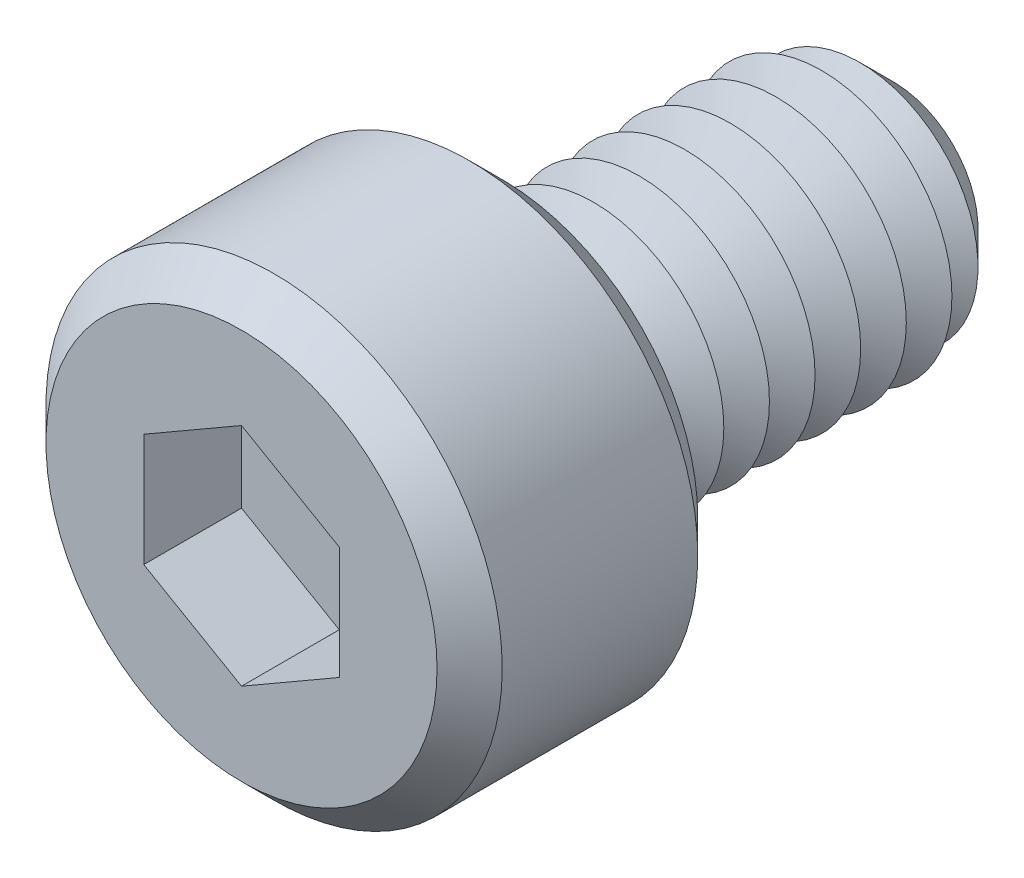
ISO-10303-21;
HEADER;
FILE_DESCRIPTION(('STEP AP214'),'2;1');
FILE_NAME('part.step','',(''),(''),'','','');
FILE_SCHEMA(('AUTOMOTIVE_DESIGN { 1 0 10303 214 1 1 1 1 }'));
ENDSEC;
DATA;
#1=APPLICATION_CONTEXT('core data for automotive mechanical design processes');
#2=APPLICATION_PROTOCOL_DEFINITION('international standard','automotive_design',2000,#1);
#3=PRODUCT_CONTEXT('',#1,'mechanical');
#4=PRODUCT('Part','Part','',(#3));
#5=PRODUCT_RELATED_PRODUCT_CATEGORY('part','',(#4));
#6=PRODUCT_DEFINITION_FORMATION('','',#4);
#7=PRODUCT_DEFINITION_CONTEXT('part definition',#1,'design');
#8=PRODUCT_DEFINITION('design','',#6,#7);
#9=PRODUCT_DEFINITION_SHAPE('','',#8);
#10=(LENGTH_UNIT() NAMED_UNIT(*) SI_UNIT(.MILLI.,.METRE.));
#11=(NAMED_UNIT(*) PLANE_ANGLE_UNIT() SI_UNIT($,.RADIAN.));
#12=(NAMED_UNIT(*) SI_UNIT($,.STERADIAN.) SOLID_ANGLE_UNIT());
#13=UNCERTAINTY_MEASURE_WITH_UNIT(LENGTH_MEASURE(1.E-05),#10,'distance_accuracy_value','');
#14=(GEOMETRIC_REPRESENTATION_CONTEXT(3) GLOBAL_UNCERTAINTY_ASSIGNED_CONTEXT((#13)) GLOBAL_UNIT_ASSIGNED_CONTEXT((#10,
#11,#12)) REPRESENTATION_CONTEXT('',''));
#15=CARTESIAN_POINT('',(0.,0.,0.));
#16=DIRECTION('',(0.,0.,1.));
#17=DIRECTION('',(1.,0.,0.));
#18=AXIS2_PLACEMENT_3D('',#15,#16,#17);
#19=CARTESIAN_POINT('',(0.,0.,4.));
#20=DIRECTION('',(0.,0.,-1.));
#21=DIRECTION('',(-1.,0.,0.));
#22=AXIS2_PLACEMENT_3D('',#19,#20,#21);
#23=CYLINDRICAL_SURFACE('',#22,3.5);
#24=CARTESIAN_POINT('',(0.,0.,0.500000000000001));
#25=DIRECTION('',(0.,0.,1.));
#26=DIRECTION('',(1.,0.,0.));
#27=AXIS2_PLACEMENT_3D('',#24,#25,#26);
#28=CIRCLE('',#27,3.5);
#29=CARTESIAN_POINT('',(3.5,0.,0.500000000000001));
#30=VERTEX_POINT('',#29);
#31=EDGE_CURVE('E241',#30,#30,#28,.T.);
#32=ORIENTED_EDGE('',*,*,#31,.T.);
#33=EDGE_LOOP('',(#32));
#34=FACE_BOUND('',#33,.T.);
#35=CARTESIAN_POINT('',(0.,0.,3.5));
#36=DIRECTION('',(0.,0.,1.));
#37=DIRECTION('',(1.,0.,0.));
#38=AXIS2_PLACEMENT_3D('',#35,#36,#37);
#39=CIRCLE('',#38,3.5);
#40=CARTESIAN_POINT('',(3.5,0.,3.5));
#41=VERTEX_POINT('',#40);
#42=EDGE_CURVE('E235',#41,#41,#39,.F.);
#43=ORIENTED_EDGE('',*,*,#42,.T.);
#44=EDGE_LOOP('',(#43));
#45=FACE_BOUND('',#44,.T.);
#46=ADVANCED_FACE('F39',(#34,#45),#23,.T.);
#47=CARTESIAN_POINT('',(0.,0.,4.));
#48=DIRECTION('',(0.,0.,1.));
#49=DIRECTION('',(1.,0.,0.));
#50=AXIS2_PLACEMENT_3D('',#47,#48,#49);
#51=PLANE('',#50);
#52=CARTESIAN_POINT('',(0.,0.,4.));
#53=DIRECTION('',(0.,0.,1.));
#54=DIRECTION('',(1.,0.,0.));
#55=AXIS2_PLACEMENT_3D('',#52,#53,#54);
#56=CIRCLE('',#55,3.);
#57=CARTESIAN_POINT('',(3.,0.,4.));
#58=VERTEX_POINT('',#57);
#59=EDGE_CURVE('E11',#58,#58,#56,.T.);
#60=ORIENTED_EDGE('',*,*,#59,.T.);
#61=EDGE_LOOP('',(#60));
#62=FACE_BOUND('',#61,.T.);
#63=DIRECTION('',(-0.866025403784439,0.5,0.));
#64=VECTOR('',#63,1.);
#65=CARTESIAN_POINT('',(1.5,0.866025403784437,4.));
#66=LINE('',#65,#64);
#67=CARTESIAN_POINT('',(1.5,0.866025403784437,4.));
#68=VERTEX_POINT('',#67);
#69=CARTESIAN_POINT('',(0.,1.73205080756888,4.));
#70=VERTEX_POINT('',#69);
#71=EDGE_CURVE('E55',#68,#70,#66,.T.);
#72=ORIENTED_EDGE('',*,*,#71,.F.);
#73=DIRECTION('',(0.,1.,0.));
#74=VECTOR('',#73,1.);
#75=CARTESIAN_POINT('',(1.5,-0.866025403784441,4.));
#76=LINE('',#75,#74);
#77=CARTESIAN_POINT('',(1.5,-0.866025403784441,4.));
#78=VERTEX_POINT('',#77);
#79=EDGE_CURVE('E151',#78,#68,#76,.T.);
#80=ORIENTED_EDGE('',*,*,#79,.F.);
#81=DIRECTION('',(0.866025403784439,0.5,0.));
#82=VECTOR('',#81,1.);
#83=CARTESIAN_POINT('',(0.,-1.73205080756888,4.));
#84=LINE('',#83,#82);
#85=CARTESIAN_POINT('',(0.,-1.73205080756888,4.));
#86=VERTEX_POINT('',#85);
#87=EDGE_CURVE('E148',#86,#78,#84,.T.);
#88=ORIENTED_EDGE('',*,*,#87,.F.);
#89=DIRECTION('',(0.866025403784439,-0.5,0.));
#90=VECTOR('',#89,1.);
#91=CARTESIAN_POINT('',(-1.5,-0.86602540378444,4.));
#92=LINE('',#91,#90);
#93=CARTESIAN_POINT('',(-1.5,-0.86602540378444,4.));
#94=VERTEX_POINT('',#93);
#95=EDGE_CURVE('E103',#94,#86,#92,.T.);
#96=ORIENTED_EDGE('',*,*,#95,.F.);
#97=DIRECTION('',(0.,-1.,0.));
#98=VECTOR('',#97,1.);
#99=CARTESIAN_POINT('',(-1.5,0.866025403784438,4.));
#100=LINE('',#99,#98);
#101=CARTESIAN_POINT('',(-1.5,0.866025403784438,4.));
#102=VERTEX_POINT('',#101);
#103=EDGE_CURVE('E142',#102,#94,#100,.T.);
#104=ORIENTED_EDGE('',*,*,#103,.F.);
#105=DIRECTION('',(-0.866025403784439,-0.5,0.));
#106=VECTOR('',#105,1.);
#107=CARTESIAN_POINT('',(0.,1.73205080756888,4.));
#108=LINE('',#107,#106);
#109=EDGE_CURVE('E137',#70,#102,#108,.T.);
#110=ORIENTED_EDGE('',*,*,#109,.F.);
#111=EDGE_LOOP('',(#72,#80,#88,#96,#104,#110));
#112=FACE_BOUND('',#111,.T.);
#113=ADVANCED_FACE('F259',(#62,#112),#51,.T.);
#114=CARTESIAN_POINT('',(0.,0.,0.));
#115=DIRECTION('',(0.,0.,1.));
#116=DIRECTION('',(1.,0.,0.));
#117=AXIS2_PLACEMENT_3D('',#114,#115,#116);
#118=PLANE('',#117);
#119=CARTESIAN_POINT('',(0.,0.,0.));
#120=DIRECTION('',(0.,0.,1.));
#121=DIRECTION('',(1.,0.,0.));
#122=AXIS2_PLACEMENT_3D('',#119,#120,#121);
#123=CIRCLE('',#122,3.);
#124=CARTESIAN_POINT('',(3.,0.,0.));
#125=VERTEX_POINT('',#124);
#126=EDGE_CURVE('E48',#125,#125,#123,.F.);
#127=ORIENTED_EDGE('',*,*,#126,.T.);
#128=EDGE_LOOP('',(#127));
#129=FACE_BOUND('',#128,.T.);
#130=CARTESIAN_POINT('',(0.,0.,0.));
#131=DIRECTION('',(0.,0.,1.));
#132=DIRECTION('',(1.,0.,0.));
#133=AXIS2_PLACEMENT_3D('',#130,#131,#132);
#134=CIRCLE('',#133,2.);
#135=CARTESIAN_POINT('',(2.,0.,0.));
#136=VERTEX_POINT('',#135);
#137=EDGE_CURVE('E227',#136,#136,#134,.T.);
#138=ORIENTED_EDGE('',*,*,#137,.T.);
#139=EDGE_LOOP('',(#138));
#140=FACE_BOUND('',#139,.T.);
#141=ADVANCED_FACE('F248',(#129,#140),#118,.F.);
#142=CARTESIAN_POINT('',(0.,0.,0.));
#143=DIRECTION('',(0.,0.,1.));
#144=DIRECTION('',(1.,0.,0.));
#145=AXIS2_PLACEMENT_3D('',#142,#143,#144);
#146=CONICAL_SURFACE('',#145,2.,1.0471975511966);
#147=CARTESIAN_POINT('',(0.,0.,-0.35));
#148=DIRECTION('',(0.,0.,1.));
#149=DIRECTION('',(1.,0.,0.));
#150=AXIS2_PLACEMENT_3D('',#147,#148,#149);
#151=CIRCLE('',#150,1.39378221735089);
#152=CARTESIAN_POINT('',(1.39378221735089,0.,-0.35));
#153=VERTEX_POINT('',#152);
#154=EDGE_CURVE('E223',#153,#153,#151,.T.);
#155=ORIENTED_EDGE('',*,*,#154,.T.);
#156=EDGE_LOOP('',(#155));
#157=FACE_BOUND('',#156,.T.);
#158=ORIENTED_EDGE('',*,*,#137,.F.);
#159=EDGE_LOOP('',(#158));
#160=FACE_BOUND('',#159,.T.);
#161=ADVANCED_FACE('F372',(#157,#160),#146,.T.);
#162=CARTESIAN_POINT('',(0.,0.,-0.35));
#163=DIRECTION('',(0.,0.,-1.));
#164=DIRECTION('',(-1.,0.,0.));
#165=AXIS2_PLACEMENT_3D('',#162,#163,#164);
#166=CONICAL_SURFACE('',#165,1.39378221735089,1.0471975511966);
#167=CARTESIAN_POINT('',(0.,0.,-0.7));
#168=DIRECTION('',(0.,0.,1.));
#169=DIRECTION('',(1.,0.,0.));
#170=AXIS2_PLACEMENT_3D('',#167,#168,#169);
#171=CIRCLE('',#170,2.);
#172=CARTESIAN_POINT('',(2.,0.,-0.7));
#173=VERTEX_POINT('',#172);
#174=EDGE_CURVE('E219',#173,#173,#171,.T.);
#175=ORIENTED_EDGE('',*,*,#174,.T.);
#176=EDGE_LOOP('',(#175));
#177=FACE_BOUND('',#176,.T.);
#178=ORIENTED_EDGE('',*,*,#154,.F.);
#179=EDGE_LOOP('',(#178));
#180=FACE_BOUND('',#179,.T.);
#181=ADVANCED_FACE('F368',(#177,#180),#166,.T.);
#182=CARTESIAN_POINT('',(0.,0.,-0.7));
#183=DIRECTION('',(0.,0.,1.));
#184=DIRECTION('',(1.,0.,0.));
#185=AXIS2_PLACEMENT_3D('',#182,#183,#184);
#186=CONICAL_SURFACE('',#185,2.,1.0471975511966);
#187=CARTESIAN_POINT('',(0.,0.,-1.05));
#188=DIRECTION('',(0.,0.,1.));
#189=DIRECTION('',(1.,0.,0.));
#190=AXIS2_PLACEMENT_3D('',#187,#188,#189);
#191=CIRCLE('',#190,1.39378221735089);
#192=CARTESIAN_POINT('',(1.39378221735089,0.,-1.05));
#193=VERTEX_POINT('',#192);
#194=EDGE_CURVE('E215',#193,#193,#191,.T.);
#195=ORIENTED_EDGE('',*,*,#194,.T.);
#196=EDGE_LOOP('',(#195));
#197=FACE_BOUND('',#196,.T.);
#198=ORIENTED_EDGE('',*,*,#174,.F.);
#199=EDGE_LOOP('',(#198));
#200=FACE_BOUND('',#199,.T.);
#201=ADVANCED_FACE('F364',(#197,#200),#186,.T.);
#202=CARTESIAN_POINT('',(0.,0.,-1.05));
#203=DIRECTION('',(0.,0.,-1.));
#204=DIRECTION('',(-1.,0.,0.));
#205=AXIS2_PLACEMENT_3D('',#202,#203,#204);
#206=CONICAL_SURFACE('',#205,1.39378221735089,1.0471975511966);
#207=CARTESIAN_POINT('',(0.,0.,-1.4));
#208=DIRECTION('',(0.,0.,1.));
#209=DIRECTION('',(1.,0.,0.));
#210=AXIS2_PLACEMENT_3D('',#207,#208,#209);
#211=CIRCLE('',#210,2.);
#212=CARTESIAN_POINT('',(2.,0.,-1.4));
#213=VERTEX_POINT('',#212);
#214=EDGE_CURVE('E211',#213,#213,#211,.T.);
#215=ORIENTED_EDGE('',*,*,#214,.T.);
#216=EDGE_LOOP('',(#215));
#217=FACE_BOUND('',#216,.T.);
#218=ORIENTED_EDGE('',*,*,#194,.F.);
#219=EDGE_LOOP('',(#218));
#220=FACE_BOUND('',#219,.T.);
#221=ADVANCED_FACE('F360',(#217,#220),#206,.T.);
#222=CARTESIAN_POINT('',(0.,0.,-1.4));
#223=DIRECTION('',(0.,0.,1.));
#224=DIRECTION('',(1.,0.,0.));
#225=AXIS2_PLACEMENT_3D('',#222,#223,#224);
#226=CONICAL_SURFACE('',#225,2.,1.0471975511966);
#227=CARTESIAN_POINT('',(0.,0.,-1.75));
#228=DIRECTION('',(0.,0.,1.));
#229=DIRECTION('',(1.,0.,0.));
#230=AXIS2_PLACEMENT_3D('',#227,#228,#229);
#231=CIRCLE('',#230,1.39378221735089);
#232=CARTESIAN_POINT('',(1.39378221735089,0.,-1.75));
#233=VERTEX_POINT('',#232);
#234=EDGE_CURVE('E207',#233,#233,#231,.T.);
#235=ORIENTED_EDGE('',*,*,#234,.T.);
#236=EDGE_LOOP('',(#235));
#237=FACE_BOUND('',#236,.T.);
#238=ORIENTED_EDGE('',*,*,#214,.F.);
#239=EDGE_LOOP('',(#238));
#240=FACE_BOUND('',#239,.T.);
#241=ADVANCED_FACE('F356',(#237,#240),#226,.T.);
#242=CARTESIAN_POINT('',(0.,0.,-1.75));
#243=DIRECTION('',(0.,0.,-1.));
#244=DIRECTION('',(-1.,0.,0.));
#245=AXIS2_PLACEMENT_3D('',#242,#243,#244);
#246=CONICAL_SURFACE('',#245,1.39378221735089,1.0471975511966);
#247=CARTESIAN_POINT('',(0.,0.,-2.1));
#248=DIRECTION('',(0.,0.,1.));
#249=DIRECTION('',(1.,0.,0.));
#250=AXIS2_PLACEMENT_3D('',#247,#248,#249);
#251=CIRCLE('',#250,2.);
#252=CARTESIAN_POINT('',(2.,0.,-2.1));
#253=VERTEX_POINT('',#252);
#254=EDGE_CURVE('E203',#253,#253,#251,.T.);
#255=ORIENTED_EDGE('',*,*,#254,.T.);
#256=EDGE_LOOP('',(#255));
#257=FACE_BOUND('',#256,.T.);
#258=ORIENTED_EDGE('',*,*,#234,.F.);
#259=EDGE_LOOP('',(#258));
#260=FACE_BOUND('',#259,.T.);
#261=ADVANCED_FACE('F352',(#257,#260),#246,.T.);
#262=CARTESIAN_POINT('',(0.,0.,-2.1));
#263=DIRECTION('',(0.,0.,1.));
#264=DIRECTION('',(1.,0.,0.));
#265=AXIS2_PLACEMENT_3D('',#262,#263,#264);
#266=CONICAL_SURFACE('',#265,2.,1.0471975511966);
#267=CARTESIAN_POINT('',(0.,0.,-2.45));
#268=DIRECTION('',(0.,0.,1.));
#269=DIRECTION('',(1.,0.,0.));
#270=AXIS2_PLACEMENT_3D('',#267,#268,#269);
#271=CIRCLE('',#270,1.39378221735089);
#272=CARTESIAN_POINT('',(1.39378221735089,0.,-2.45));
#273=VERTEX_POINT('',#272);
#274=EDGE_CURVE('E199',#273,#273,#271,.T.);
#275=ORIENTED_EDGE('',*,*,#274,.T.);
#276=EDGE_LOOP('',(#275));
#277=FACE_BOUND('',#276,.T.);
#278=ORIENTED_EDGE('',*,*,#254,.F.);
#279=EDGE_LOOP('',(#278));
#280=FACE_BOUND('',#279,.T.);
#281=ADVANCED_FACE('F348',(#277,#280),#266,.T.);
#282=CARTESIAN_POINT('',(0.,0.,-2.45));
#283=DIRECTION('',(0.,0.,-1.));
#284=DIRECTION('',(-1.,0.,0.));
#285=AXIS2_PLACEMENT_3D('',#282,#283,#284);
#286=CONICAL_SURFACE('',#285,1.39378221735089,1.0471975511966);
#287=CARTESIAN_POINT('',(0.,0.,-2.8));
#288=DIRECTION('',(0.,0.,1.));
#289=DIRECTION('',(1.,0.,0.));
#290=AXIS2_PLACEMENT_3D('',#287,#288,#289);
#291=CIRCLE('',#290,2.);
#292=CARTESIAN_POINT('',(2.,0.,-2.8));
#293=VERTEX_POINT('',#292);
#294=EDGE_CURVE('E195',#293,#293,#291,.T.);
#295=ORIENTED_EDGE('',*,*,#294,.T.);
#296=EDGE_LOOP('',(#295));
#297=FACE_BOUND('',#296,.T.);
#298=ORIENTED_EDGE('',*,*,#274,.F.);
#299=EDGE_LOOP('',(#298));
#300=FACE_BOUND('',#299,.T.);
#301=ADVANCED_FACE('F344',(#297,#300),#286,.T.);
#302=CARTESIAN_POINT('',(0.,0.,-2.8));
#303=DIRECTION('',(0.,0.,1.));
#304=DIRECTION('',(1.,0.,0.));
#305=AXIS2_PLACEMENT_3D('',#302,#303,#304);
#306=CONICAL_SURFACE('',#305,2.,1.0471975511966);
#307=CARTESIAN_POINT('',(0.,0.,-3.15));
#308=DIRECTION('',(0.,0.,1.));
#309=DIRECTION('',(1.,0.,0.));
#310=AXIS2_PLACEMENT_3D('',#307,#308,#309);
#311=CIRCLE('',#310,1.39378221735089);
#312=CARTESIAN_POINT('',(1.39378221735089,0.,-3.15));
#313=VERTEX_POINT('',#312);
#314=EDGE_CURVE('E191',#313,#313,#311,.T.);
#315=ORIENTED_EDGE('',*,*,#314,.T.);
#316=EDGE_LOOP('',(#315));
#317=FACE_BOUND('',#316,.T.);
#318=ORIENTED_EDGE('',*,*,#294,.F.);
#319=EDGE_LOOP('',(#318));
#320=FACE_BOUND('',#319,.T.);
#321=ADVANCED_FACE('F340',(#317,#320),#306,.T.);
#322=CARTESIAN_POINT('',(0.,0.,-3.15));
#323=DIRECTION('',(0.,0.,-1.));
#324=DIRECTION('',(-1.,0.,0.));
#325=AXIS2_PLACEMENT_3D('',#322,#323,#324);
#326=CONICAL_SURFACE('',#325,1.39378221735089,1.0471975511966);
#327=CARTESIAN_POINT('',(0.,0.,-3.5));
#328=DIRECTION('',(0.,0.,1.));
#329=DIRECTION('',(1.,0.,0.));
#330=AXIS2_PLACEMENT_3D('',#327,#328,#329);
#331=CIRCLE('',#330,2.);
#332=CARTESIAN_POINT('',(2.,0.,-3.5));
#333=VERTEX_POINT('',#332);
#334=EDGE_CURVE('E187',#333,#333,#331,.T.);
#335=ORIENTED_EDGE('',*,*,#334,.T.);
#336=EDGE_LOOP('',(#335));
#337=FACE_BOUND('',#336,.T.);
#338=ORIENTED_EDGE('',*,*,#314,.F.);
#339=EDGE_LOOP('',(#338));
#340=FACE_BOUND('',#339,.T.);
#341=ADVANCED_FACE('F336',(#337,#340),#326,.T.);
#342=CARTESIAN_POINT('',(0.,0.,-3.5));
#343=DIRECTION('',(0.,0.,1.));
#344=DIRECTION('',(1.,0.,0.));
#345=AXIS2_PLACEMENT_3D('',#342,#343,#344);
#346=CONICAL_SURFACE('',#345,2.,1.0471975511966);
#347=CARTESIAN_POINT('',(0.,0.,-3.85));
#348=DIRECTION('',(0.,0.,1.));
#349=DIRECTION('',(1.,0.,0.));
#350=AXIS2_PLACEMENT_3D('',#347,#348,#349);
#351=CIRCLE('',#350,1.39378221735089);
#352=CARTESIAN_POINT('',(1.39378221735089,0.,-3.85));
#353=VERTEX_POINT('',#352);
#354=EDGE_CURVE('E183',#353,#353,#351,.T.);
#355=ORIENTED_EDGE('',*,*,#354,.T.);
#356=EDGE_LOOP('',(#355));
#357=FACE_BOUND('',#356,.T.);
#358=ORIENTED_EDGE('',*,*,#334,.F.);
#359=EDGE_LOOP('',(#358));
#360=FACE_BOUND('',#359,.T.);
#361=ADVANCED_FACE('F332',(#357,#360),#346,.T.);
#362=CARTESIAN_POINT('',(0.,0.,-3.85));
#363=DIRECTION('',(0.,0.,-1.));
#364=DIRECTION('',(-1.,0.,0.));
#365=AXIS2_PLACEMENT_3D('',#362,#363,#364);
#366=CONICAL_SURFACE('',#365,1.39378221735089,1.0471975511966);
#367=CARTESIAN_POINT('',(0.,0.,-4.2));
#368=DIRECTION('',(0.,0.,1.));
#369=DIRECTION('',(1.,0.,0.));
#370=AXIS2_PLACEMENT_3D('',#367,#368,#369);
#371=CIRCLE('',#370,2.);
#372=CARTESIAN_POINT('',(2.,0.,-4.2));
#373=VERTEX_POINT('',#372);
#374=EDGE_CURVE('E179',#373,#373,#371,.T.);
#375=ORIENTED_EDGE('',*,*,#374,.T.);
#376=EDGE_LOOP('',(#375));
#377=FACE_BOUND('',#376,.T.);
#378=ORIENTED_EDGE('',*,*,#354,.F.);
#379=EDGE_LOOP('',(#378));
#380=FACE_BOUND('',#379,.T.);
#381=ADVANCED_FACE('F328',(#377,#380),#366,.T.);
#382=CARTESIAN_POINT('',(0.,0.,-4.2));
#383=DIRECTION('',(0.,0.,1.));
#384=DIRECTION('',(1.,0.,0.));
#385=AXIS2_PLACEMENT_3D('',#382,#383,#384);
#386=CONICAL_SURFACE('',#385,2.,1.0471975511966);
#387=CARTESIAN_POINT('',(0.,0.,-4.55));
#388=DIRECTION('',(0.,0.,1.));
#389=DIRECTION('',(1.,0.,0.));
#390=AXIS2_PLACEMENT_3D('',#387,#388,#389);
#391=CIRCLE('',#390,1.39378221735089);
#392=CARTESIAN_POINT('',(1.39378221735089,0.,-4.55));
#393=VERTEX_POINT('',#392);
#394=EDGE_CURVE('E175',#393,#393,#391,.T.);
#395=ORIENTED_EDGE('',*,*,#394,.T.);
#396=EDGE_LOOP('',(#395));
#397=FACE_BOUND('',#396,.T.);
#398=ORIENTED_EDGE('',*,*,#374,.F.);
#399=EDGE_LOOP('',(#398));
#400=FACE_BOUND('',#399,.T.);
#401=ADVANCED_FACE('F324',(#397,#400),#386,.T.);
#402=CARTESIAN_POINT('',(0.,0.,-4.55));
#403=DIRECTION('',(0.,0.,-1.));
#404=DIRECTION('',(-1.,0.,0.));
#405=AXIS2_PLACEMENT_3D('',#402,#403,#404);
#406=CONICAL_SURFACE('',#405,1.39378221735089,1.0471975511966);
#407=CARTESIAN_POINT('',(0.,0.,-4.9));
#408=DIRECTION('',(0.,0.,1.));
#409=DIRECTION('',(1.,0.,0.));
#410=AXIS2_PLACEMENT_3D('',#407,#408,#409);
#411=CIRCLE('',#410,2.);
#412=CARTESIAN_POINT('',(2.,0.,-4.9));
#413=VERTEX_POINT('',#412);
#414=EDGE_CURVE('E170',#413,#413,#411,.T.);
#415=ORIENTED_EDGE('',*,*,#414,.T.);
#416=EDGE_LOOP('',(#415));
#417=FACE_BOUND('',#416,.T.);
#418=ORIENTED_EDGE('',*,*,#394,.F.);
#419=EDGE_LOOP('',(#418));
#420=FACE_BOUND('',#419,.T.);
#421=ADVANCED_FACE('F320',(#417,#420),#406,.T.);
#422=CARTESIAN_POINT('',(0.,0.,-4.9));
#423=DIRECTION('',(0.,0.,1.));
#424=DIRECTION('',(1.,0.,0.));
#425=AXIS2_PLACEMENT_3D('',#422,#423,#424);
#426=CONICAL_SURFACE('',#425,2.,1.0471975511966);
#427=CARTESIAN_POINT('',(0.,0.,-5.25));
#428=DIRECTION('',(0.,0.,1.));
#429=DIRECTION('',(1.,0.,0.));
#430=AXIS2_PLACEMENT_3D('',#427,#428,#429);
#431=CIRCLE('',#430,1.39378221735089);
#432=CARTESIAN_POINT('',(1.39378221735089,0.,-5.25));
#433=VERTEX_POINT('',#432);
#434=EDGE_CURVE('E157',#433,#433,#431,.T.);
#435=ORIENTED_EDGE('',*,*,#434,.T.);
#436=EDGE_LOOP('',(#435));
#437=FACE_BOUND('',#436,.T.);
#438=ORIENTED_EDGE('',*,*,#414,.F.);
#439=EDGE_LOOP('',(#438));
#440=FACE_BOUND('',#439,.T.);
#441=ADVANCED_FACE('F316',(#437,#440),#426,.T.);
#442=CARTESIAN_POINT('',(0.,0.,-5.25));
#443=DIRECTION('',(0.,0.,-1.));
#444=DIRECTION('',(-1.,0.,0.));
#445=AXIS2_PLACEMENT_3D('',#442,#443,#444);
#446=CONICAL_SURFACE('',#445,1.39378221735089,1.0471975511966);
#447=CARTESIAN_POINT('',(0.,0.,-5.49019237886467));
#448=DIRECTION('',(0.,0.,-1.));
#449=DIRECTION('',(-1.,0.,0.));
#450=AXIS2_PLACEMENT_3D('',#447,#448,#449);
#451=CIRCLE('',#450,1.80980762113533);
#452=CARTESIAN_POINT('',(-1.80980762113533,0.,-5.49019237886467));
#453=VERTEX_POINT('',#452);
#454=EDGE_CURVE('E174',#453,#453,#451,.T.);
#455=ORIENTED_EDGE('',*,*,#454,.F.);
#456=EDGE_LOOP('',(#455));
#457=FACE_BOUND('',#456,.T.);
#458=ORIENTED_EDGE('',*,*,#434,.F.);
#459=EDGE_LOOP('',(#458));
#460=FACE_BOUND('',#459,.T.);
#461=ADVANCED_FACE('F312',(#457,#460),#446,.T.);
#462=CARTESIAN_POINT('',(0.,0.,-6.));
#463=DIRECTION('',(0.,0.,-1.));
#464=DIRECTION('',(-1.,0.,0.));
#465=AXIS2_PLACEMENT_3D('',#462,#463,#464);
#466=PLANE('',#465);
#467=CARTESIAN_POINT('',(0.,0.,-6.));
#468=DIRECTION('',(0.,0.,-1.));
#469=DIRECTION('',(-1.,0.,0.));
#470=AXIS2_PLACEMENT_3D('',#467,#468,#469);
#471=CIRCLE('',#470,0.5);
#472=CARTESIAN_POINT('',(-0.5,0.,-6.));
#473=VERTEX_POINT('',#472);
#474=EDGE_CURVE('E138',#473,#473,#471,.F.);
#475=ORIENTED_EDGE('',*,*,#474,.T.);
#476=EDGE_LOOP('',(#475));
#477=FACE_BOUND('',#476,.T.);
#478=CARTESIAN_POINT('',(0.,0.,-6.));
#479=DIRECTION('',(0.,0.,-1.));
#480=DIRECTION('',(-1.,0.,0.));
#481=AXIS2_PLACEMENT_3D('',#478,#479,#480);
#482=CIRCLE('',#481,1.3);
#483=CARTESIAN_POINT('',(-1.3,0.,-6.));
#484=VERTEX_POINT('',#483);
#485=EDGE_CURVE('E231',#484,#484,#482,.T.);
#486=ORIENTED_EDGE('',*,*,#485,.T.);
#487=EDGE_LOOP('',(#486));
#488=FACE_BOUND('',#487,.T.);
#489=ADVANCED_FACE('F315',(#477,#488),#466,.T.);
#490=CARTESIAN_POINT('',(0.,0.,-6.));
#491=DIRECTION('',(0.,0.,1.));
#492=DIRECTION('',(1.,0.,0.));
#493=AXIS2_PLACEMENT_3D('',#490,#491,#492);
#494=CONICAL_SURFACE('',#493,1.3,0.785398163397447);
#495=ORIENTED_EDGE('',*,*,#485,.F.);
#496=EDGE_LOOP('',(#495));
#497=FACE_BOUND('',#496,.T.);
#498=ORIENTED_EDGE('',*,*,#454,.T.);
#499=EDGE_LOOP('',(#498));
#500=FACE_BOUND('',#499,.T.);
#501=ADVANCED_FACE('F311',(#497,#500),#494,.T.);
#502=CARTESIAN_POINT('',(1.5,0.866025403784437,2.5));
#503=DIRECTION('',(0.5,0.866025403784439,0.));
#504=DIRECTION('',(-0.866025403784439,0.5,0.));
#505=AXIS2_PLACEMENT_3D('',#502,#503,#504);
#506=PLANE('',#505);
#507=ORIENTED_EDGE('',*,*,#71,.T.);
#508=DIRECTION('',(0.,0.,1.));
#509=VECTOR('',#508,1.);
#510=CARTESIAN_POINT('',(0.,1.73205080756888,2.5));
#511=LINE('',#510,#509);
#512=CARTESIAN_POINT('',(0.,1.73205080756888,2.5));
#513=VERTEX_POINT('',#512);
#514=EDGE_CURVE('E85',#513,#70,#511,.T.);
#515=ORIENTED_EDGE('',*,*,#514,.F.);
#516=DIRECTION('',(-0.866025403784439,0.5,0.));
#517=VECTOR('',#516,1.);
#518=CARTESIAN_POINT('',(1.5,0.866025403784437,2.5));
#519=LINE('',#518,#517);
#520=CARTESIAN_POINT('',(1.5,0.866025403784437,2.5));
#521=VERTEX_POINT('',#520);
#522=EDGE_CURVE('E154',#521,#513,#519,.T.);
#523=ORIENTED_EDGE('',*,*,#522,.F.);
#524=DIRECTION('',(0.,0.,1.));
#525=VECTOR('',#524,1.);
#526=CARTESIAN_POINT('',(1.5,0.866025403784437,2.5));
#527=LINE('',#526,#525);
#528=EDGE_CURVE('E63',#521,#68,#527,.T.);
#529=ORIENTED_EDGE('',*,*,#528,.T.);
#530=EDGE_LOOP('',(#507,#515,#523,#529));
#531=FACE_BOUND('',#530,.T.);
#532=ADVANCED_FACE('F301',(#531),#506,.F.);
#533=CARTESIAN_POINT('',(1.5,-0.866025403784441,2.5));
#534=DIRECTION('',(1.,0.,0.));
#535=DIRECTION('',(0.,1.,0.));
#536=AXIS2_PLACEMENT_3D('',#533,#534,#535);
#537=PLANE('',#536);
#538=ORIENTED_EDGE('',*,*,#79,.T.);
#539=ORIENTED_EDGE('',*,*,#528,.F.);
#540=DIRECTION('',(0.,1.,0.));
#541=VECTOR('',#540,1.);
#542=CARTESIAN_POINT('',(1.5,-0.866025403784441,2.5));
#543=LINE('',#542,#541);
#544=CARTESIAN_POINT('',(1.5,-0.866025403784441,2.5));
#545=VERTEX_POINT('',#544);
#546=EDGE_CURVE('E117',#545,#521,#543,.T.);
#547=ORIENTED_EDGE('',*,*,#546,.F.);
#548=DIRECTION('',(0.,0.,1.));
#549=VECTOR('',#548,1.);
#550=CARTESIAN_POINT('',(1.5,-0.866025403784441,2.5));
#551=LINE('',#550,#549);
#552=EDGE_CURVE('E108',#545,#78,#551,.T.);
#553=ORIENTED_EDGE('',*,*,#552,.T.);
#554=EDGE_LOOP('',(#538,#539,#547,#553));
#555=FACE_BOUND('',#554,.T.);
#556=ADVANCED_FACE('F298',(#555),#537,.F.);
#557=CARTESIAN_POINT('',(0.,-1.73205080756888,2.5));
#558=DIRECTION('',(0.5,-0.866025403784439,0.));
#559=DIRECTION('',(0.866025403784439,0.5,0.));
#560=AXIS2_PLACEMENT_3D('',#557,#558,#559);
#561=PLANE('',#560);
#562=ORIENTED_EDGE('',*,*,#87,.T.);
#563=ORIENTED_EDGE('',*,*,#552,.F.);
#564=DIRECTION('',(0.866025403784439,0.5,0.));
#565=VECTOR('',#564,1.);
#566=CARTESIAN_POINT('',(0.,-1.73205080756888,2.5));
#567=LINE('',#566,#565);
#568=CARTESIAN_POINT('',(0.,-1.73205080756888,2.5));
#569=VERTEX_POINT('',#568);
#570=EDGE_CURVE('E112',#569,#545,#567,.T.);
#571=ORIENTED_EDGE('',*,*,#570,.F.);
#572=DIRECTION('',(0.,0.,1.));
#573=VECTOR('',#572,1.);
#574=CARTESIAN_POINT('',(0.,-1.73205080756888,2.5));
#575=LINE('',#574,#573);
#576=EDGE_CURVE('E96',#569,#86,#575,.T.);
#577=ORIENTED_EDGE('',*,*,#576,.T.);
#578=EDGE_LOOP('',(#562,#563,#571,#577));
#579=FACE_BOUND('',#578,.T.);
#580=ADVANCED_FACE('F113',(#579),#561,.F.);
#581=CARTESIAN_POINT('',(-1.5,-0.86602540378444,2.5));
#582=DIRECTION('',(-0.5,-0.866025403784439,0.));
#583=DIRECTION('',(0.866025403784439,-0.5,0.));
#584=AXIS2_PLACEMENT_3D('',#581,#582,#583);
#585=PLANE('',#584);
#586=ORIENTED_EDGE('',*,*,#95,.T.);
#587=ORIENTED_EDGE('',*,*,#576,.F.);
#588=DIRECTION('',(0.866025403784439,-0.5,0.));
#589=VECTOR('',#588,1.);
#590=CARTESIAN_POINT('',(-1.5,-0.86602540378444,2.5));
#591=LINE('',#590,#589);
#592=CARTESIAN_POINT('',(-1.5,-0.86602540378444,2.5));
#593=VERTEX_POINT('',#592);
#594=EDGE_CURVE('E100',#593,#569,#591,.T.);
#595=ORIENTED_EDGE('',*,*,#594,.F.);
#596=DIRECTION('',(0.,0.,1.));
#597=VECTOR('',#596,1.);
#598=CARTESIAN_POINT('',(-1.5,-0.86602540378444,2.5));
#599=LINE('',#598,#597);
#600=EDGE_CURVE('E109',#593,#94,#599,.T.);
#601=ORIENTED_EDGE('',*,*,#600,.T.);
#602=EDGE_LOOP('',(#586,#587,#595,#601));
#603=FACE_BOUND('',#602,.T.);
#604=ADVANCED_FACE('F98',(#603),#585,.F.);
#605=CARTESIAN_POINT('',(-1.5,0.866025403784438,2.5));
#606=DIRECTION('',(-1.,0.,0.));
#607=DIRECTION('',(0.,0.,1.));
#608=AXIS2_PLACEMENT_3D('',#605,#606,#607);
#609=PLANE('',#608);
#610=ORIENTED_EDGE('',*,*,#103,.T.);
#611=ORIENTED_EDGE('',*,*,#600,.F.);
#612=DIRECTION('',(0.,-1.,0.));
#613=VECTOR('',#612,1.);
#614=CARTESIAN_POINT('',(-1.5,0.866025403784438,2.5));
#615=LINE('',#614,#613);
#616=CARTESIAN_POINT('',(-1.5,0.866025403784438,2.5));
#617=VERTEX_POINT('',#616);
#618=EDGE_CURVE('E123',#617,#593,#615,.T.);
#619=ORIENTED_EDGE('',*,*,#618,.F.);
#620=DIRECTION('',(0.,0.,1.));
#621=VECTOR('',#620,1.);
#622=CARTESIAN_POINT('',(-1.5,0.866025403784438,2.5));
#623=LINE('',#622,#621);
#624=EDGE_CURVE('E162',#617,#102,#623,.T.);
#625=ORIENTED_EDGE('',*,*,#624,.T.);
#626=EDGE_LOOP('',(#610,#611,#619,#625));
#627=FACE_BOUND('',#626,.T.);
#628=ADVANCED_FACE('F295',(#627),#609,.F.);
#629=CARTESIAN_POINT('',(0.,1.73205080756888,2.5));
#630=DIRECTION('',(-0.5,0.866025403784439,0.));
#631=DIRECTION('',(-0.866025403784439,-0.5,0.));
#632=AXIS2_PLACEMENT_3D('',#629,#630,#631);
#633=PLANE('',#632);
#634=ORIENTED_EDGE('',*,*,#109,.T.);
#635=ORIENTED_EDGE('',*,*,#624,.F.);
#636=DIRECTION('',(-0.866025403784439,-0.5,0.));
#637=VECTOR('',#636,1.);
#638=CARTESIAN_POINT('',(0.,1.73205080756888,2.5));
#639=LINE('',#638,#637);
#640=EDGE_CURVE('E129',#513,#617,#639,.T.);
#641=ORIENTED_EDGE('',*,*,#640,.F.);
#642=ORIENTED_EDGE('',*,*,#514,.T.);
#643=EDGE_LOOP('',(#634,#635,#641,#642));
#644=FACE_BOUND('',#643,.T.);
#645=ADVANCED_FACE('F274',(#644),#633,.F.);
#646=CARTESIAN_POINT('',(0.,0.,2.5));
#647=DIRECTION('',(0.,0.,1.));
#648=DIRECTION('',(1.,0.,0.));
#649=AXIS2_PLACEMENT_3D('',#646,#647,#648);
#650=PLANE('',#649);
#651=CARTESIAN_POINT('',(0.,0.,2.5));
#652=DIRECTION('',(0.,0.,1.));
#653=DIRECTION('',(1.,0.,0.));
#654=AXIS2_PLACEMENT_3D('',#651,#652,#653);
#655=CIRCLE('',#654,0.5);
#656=CARTESIAN_POINT('',(0.5,0.,2.5));
#657=VERTEX_POINT('',#656);
#658=EDGE_CURVE('E281',#657,#657,#655,.T.);
#659=ORIENTED_EDGE('',*,*,#658,.F.);
#660=EDGE_LOOP('',(#659));
#661=FACE_BOUND('',#660,.T.);
#662=ORIENTED_EDGE('',*,*,#522,.T.);
#663=ORIENTED_EDGE('',*,*,#640,.T.);
#664=ORIENTED_EDGE('',*,*,#618,.T.);
#665=ORIENTED_EDGE('',*,*,#594,.T.);
#666=ORIENTED_EDGE('',*,*,#570,.T.);
#667=ORIENTED_EDGE('',*,*,#546,.T.);
#668=EDGE_LOOP('',(#662,#663,#664,#665,#666,#667));
#669=FACE_BOUND('',#668,.T.);
#670=ADVANCED_FACE('F120',(#661,#669),#650,.T.);
#671=CARTESIAN_POINT('',(0.,0.,-7.41421356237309));
#672=DIRECTION('',(0.,0.,1.));
#673=DIRECTION('',(1.,0.,0.));
#674=AXIS2_PLACEMENT_3D('',#671,#672,#673);
#675=CYLINDRICAL_SURFACE('',#674,0.5);
#676=ORIENTED_EDGE('',*,*,#658,.T.);
#677=EDGE_LOOP('',(#676));
#678=FACE_BOUND('',#677,.T.);
#679=ORIENTED_EDGE('',*,*,#474,.F.);
#680=EDGE_LOOP('',(#679));
#681=FACE_BOUND('',#680,.T.);
#682=ADVANCED_FACE('F254',(#678,#681),#675,.F.);
#683=CARTESIAN_POINT('',(0.,0.,0.500000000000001));
#684=DIRECTION('',(0.,0.,1.));
#685=DIRECTION('',(1.,0.,0.));
#686=AXIS2_PLACEMENT_3D('',#683,#684,#685);
#687=CONICAL_SURFACE('',#686,3.5,0.785398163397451);
#688=ORIENTED_EDGE('',*,*,#126,.F.);
#689=EDGE_LOOP('',(#688));
#690=FACE_BOUND('',#689,.T.);
#691=ORIENTED_EDGE('',*,*,#31,.F.);
#692=EDGE_LOOP('',(#691));
#693=FACE_BOUND('',#692,.T.);
#694=ADVANCED_FACE('F251',(#690,#693),#687,.T.);
#695=CARTESIAN_POINT('',(0.,0.,4.));
#696=DIRECTION('',(0.,0.,-1.));
#697=DIRECTION('',(-1.,0.,0.));
#698=AXIS2_PLACEMENT_3D('',#695,#696,#697);
#699=CONICAL_SURFACE('',#698,3.,0.785398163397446);
#700=ORIENTED_EDGE('',*,*,#42,.F.);
#701=EDGE_LOOP('',(#700));
#702=FACE_BOUND('',#701,.T.);
#703=ORIENTED_EDGE('',*,*,#59,.F.);
#704=EDGE_LOOP('',(#703));
#705=FACE_BOUND('',#704,.T.);
#706=ADVANCED_FACE('F41',(#702,#705),#699,.T.);
#707=CLOSED_SHELL('',(#46,#113,#141,#161,#181,#201,#221,#241,#261,#281,#301,#321,#341,#361,#381,
#401,#421,#441,#461,#489,#501,#532,#556,#580,#604,#628,#645,#670,#682,#694,#706));
#708=MANIFOLD_SOLID_BREP('B2',#707);
#709=ADVANCED_BREP_SHAPE_REPRESENTATION('',(#18,#708),#14);
#710=SHAPE_DEFINITION_REPRESENTATION(#9,#709);
ENDSEC;
END-ISO-10303-21;
